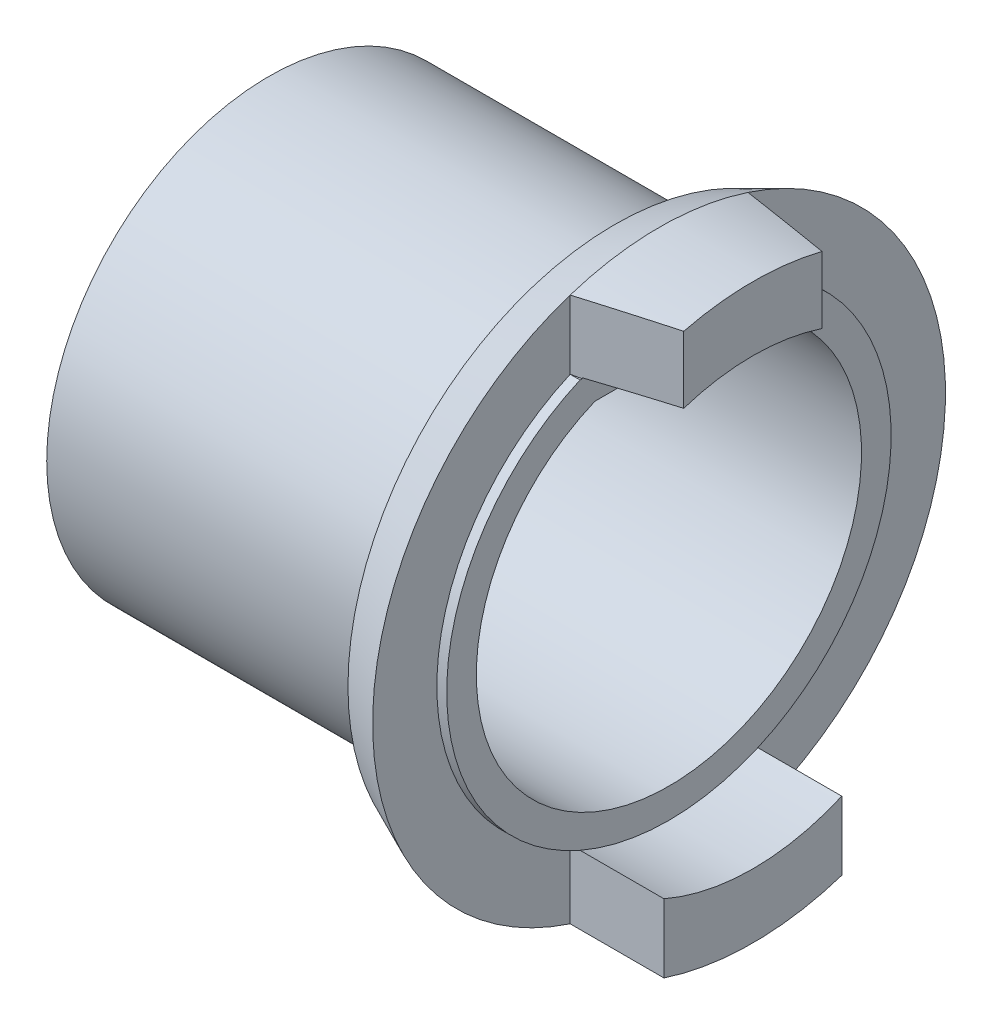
ISO-10303-21;
HEADER;
FILE_DESCRIPTION(('STEP AP214'),'2;1');
FILE_NAME('part.step','',(''),(''),'','','');
FILE_SCHEMA(('AUTOMOTIVE_DESIGN { 1 0 10303 214 1 1 1 1 }'));
ENDSEC;
DATA;
#1=APPLICATION_CONTEXT('core data for automotive mechanical design processes');
#2=APPLICATION_PROTOCOL_DEFINITION('international standard','automotive_design',2000,#1);
#3=PRODUCT_CONTEXT('',#1,'mechanical');
#4=PRODUCT('Part','Part','',(#3));
#5=PRODUCT_RELATED_PRODUCT_CATEGORY('part','',(#4));
#6=PRODUCT_DEFINITION_FORMATION('','',#4);
#7=PRODUCT_DEFINITION_CONTEXT('part definition',#1,'design');
#8=PRODUCT_DEFINITION('design','',#6,#7);
#9=PRODUCT_DEFINITION_SHAPE('','',#8);
#10=(LENGTH_UNIT() NAMED_UNIT(*) SI_UNIT(.MILLI.,.METRE.));
#11=(NAMED_UNIT(*) PLANE_ANGLE_UNIT() SI_UNIT($,.RADIAN.));
#12=(NAMED_UNIT(*) SI_UNIT($,.STERADIAN.) SOLID_ANGLE_UNIT());
#13=UNCERTAINTY_MEASURE_WITH_UNIT(LENGTH_MEASURE(1.E-05),#10,'distance_accuracy_value','');
#14=(GEOMETRIC_REPRESENTATION_CONTEXT(3) GLOBAL_UNCERTAINTY_ASSIGNED_CONTEXT((#13)) GLOBAL_UNIT_ASSIGNED_CONTEXT((#10,
#11,#12)) REPRESENTATION_CONTEXT('',''));
#15=CARTESIAN_POINT('',(0.,0.,0.));
#16=DIRECTION('',(0.,0.,1.));
#17=DIRECTION('',(1.,0.,0.));
#18=AXIS2_PLACEMENT_3D('',#15,#16,#17);
#19=CARTESIAN_POINT('',(65.7492570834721,29.0000000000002,-2.22044604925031E-13));
#20=DIRECTION('',(-1.,0.,0.));
#21=DIRECTION('',(0.,0.,1.));
#22=AXIS2_PLACEMENT_3D('',#19,#20,#21);
#23=PLANE('',#22);
#24=DIRECTION('',(0.,1.,0.));
#25=VECTOR('',#24,1.);
#26=CARTESIAN_POINT('',(65.7492570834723,-27.5680975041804,-9.00000000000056));
#27=LINE('',#26,#25);
#28=CARTESIAN_POINT('',(65.7492570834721,-27.5680975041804,-9.00000000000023));
#29=VERTEX_POINT('',#28);
#30=CARTESIAN_POINT('',(65.7492570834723,-20.6215906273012,-9.00000000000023));
#31=VERTEX_POINT('',#30);
#32=EDGE_CURVE('E263',#29,#31,#27,.T.);
#33=ORIENTED_EDGE('',*,*,#32,.F.);
#34=CARTESIAN_POINT('',(65.7492570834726,0.,-2.22044604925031E-13));
#35=DIRECTION('',(-1.,0.,0.));
#36=DIRECTION('',(0.,0.,1.));
#37=AXIS2_PLACEMENT_3D('',#34,#35,#36);
#38=CIRCLE('',#37,29.);
#39=CARTESIAN_POINT('',(65.7492570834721,27.5680975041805,-9.00000000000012));
#40=VERTEX_POINT('',#39);
#41=EDGE_CURVE('E154',#40,#29,#38,.T.);
#42=ORIENTED_EDGE('',*,*,#41,.F.);
#43=DIRECTION('',(0.,1.,0.));
#44=VECTOR('',#43,1.);
#45=CARTESIAN_POINT('',(65.7492570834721,27.5680975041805,-9.00000000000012));
#46=LINE('',#45,#44);
#47=CARTESIAN_POINT('',(65.7492570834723,20.6215906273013,-9.00000000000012));
#48=VERTEX_POINT('',#47);
#49=EDGE_CURVE('E190',#48,#40,#46,.T.);
#50=ORIENTED_EDGE('',*,*,#49,.F.);
#51=CARTESIAN_POINT('',(65.7492570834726,0.,-2.22044604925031E-13));
#52=DIRECTION('',(-1.,0.,0.));
#53=DIRECTION('',(0.,0.,1.));
#54=AXIS2_PLACEMENT_3D('',#51,#52,#53);
#55=CIRCLE('',#54,22.5);
#56=EDGE_CURVE('E223',#48,#31,#55,.T.);
#57=ORIENTED_EDGE('',*,*,#56,.T.);
#58=EDGE_LOOP('',(#33,#42,#50,#57));
#59=FACE_BOUND('',#58,.T.);
#60=ADVANCED_FACE('F32',(#59),#23,.F.);
#61=DIRECTION('',(0.,-1.,0.));
#62=VECTOR('',#61,1.);
#63=CARTESIAN_POINT('',(65.7492570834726,-27.5680975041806,8.99999999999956));
#64=LINE('',#63,#62);
#65=CARTESIAN_POINT('',(65.7492570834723,-20.6215906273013,8.99999999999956));
#66=VERTEX_POINT('',#65);
#67=CARTESIAN_POINT('',(65.7492570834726,-27.5680975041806,8.99999999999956));
#68=VERTEX_POINT('',#67);
#69=EDGE_CURVE('E55',#66,#68,#64,.T.);
#70=ORIENTED_EDGE('',*,*,#69,.F.);
#71=CARTESIAN_POINT('',(65.7492570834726,20.6215906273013,9.00000000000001));
#72=VERTEX_POINT('',#71);
#73=EDGE_CURVE('E221',#66,#72,#55,.T.);
#74=ORIENTED_EDGE('',*,*,#73,.T.);
#75=DIRECTION('',(0.,-1.,0.));
#76=VECTOR('',#75,1.);
#77=CARTESIAN_POINT('',(65.7492570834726,27.5680975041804,8.9999999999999));
#78=LINE('',#77,#76);
#79=CARTESIAN_POINT('',(65.7492570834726,27.5680975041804,8.9999999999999));
#80=VERTEX_POINT('',#79);
#81=EDGE_CURVE('E188',#80,#72,#78,.T.);
#82=ORIENTED_EDGE('',*,*,#81,.F.);
#83=EDGE_CURVE('E156',#68,#80,#38,.T.);
#84=ORIENTED_EDGE('',*,*,#83,.F.);
#85=EDGE_LOOP('',(#70,#74,#82,#84));
#86=FACE_BOUND('',#85,.T.);
#87=ADVANCED_FACE('F230',(#86),#23,.F.);
#88=CARTESIAN_POINT('',(-130.,-1.38777878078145E-13,0.));
#89=DIRECTION('',(-1.,0.,0.));
#90=DIRECTION('',(0.,0.,1.));
#91=AXIS2_PLACEMENT_3D('',#88,#89,#90);
#92=CYLINDRICAL_SURFACE('',#91,22.5);
#93=DIRECTION('',(-1.,0.,0.));
#94=VECTOR('',#93,1.);
#95=CARTESIAN_POINT('',(75.2492570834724,-20.6215906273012,-9.00000000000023));
#96=LINE('',#95,#94);
#97=CARTESIAN_POINT('',(66.7492570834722,-20.6215906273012,-9.00000000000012));
#98=VERTEX_POINT('',#97);
#99=EDGE_CURVE('E255',#98,#31,#96,.T.);
#100=ORIENTED_EDGE('',*,*,#99,.T.);
#101=ORIENTED_EDGE('',*,*,#56,.F.);
#102=DIRECTION('',(-1.,0.,0.));
#103=VECTOR('',#102,1.);
#104=CARTESIAN_POINT('',(75.2492570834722,20.6215906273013,-9.00000000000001));
#105=LINE('',#104,#103);
#106=CARTESIAN_POINT('',(66.7492570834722,20.6215906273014,-9.00000000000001));
#107=VERTEX_POINT('',#106);
#108=EDGE_CURVE('E195',#107,#48,#105,.T.);
#109=ORIENTED_EDGE('',*,*,#108,.F.);
#110=CARTESIAN_POINT('',(66.7492570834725,0.,-2.22044604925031E-13));
#111=DIRECTION('',(-1.,0.,0.));
#112=DIRECTION('',(0.,0.,1.));
#113=AXIS2_PLACEMENT_3D('',#110,#111,#112);
#114=CIRCLE('',#113,22.5);
#115=EDGE_CURVE('E222',#107,#98,#114,.T.);
#116=ORIENTED_EDGE('',*,*,#115,.T.);
#117=EDGE_LOOP('',(#100,#101,#109,#116));
#118=FACE_BOUND('',#117,.T.);
#119=ADVANCED_FACE('F254',(#118),#92,.T.);
#120=DIRECTION('',(-1.,0.,0.));
#121=VECTOR('',#120,1.);
#122=CARTESIAN_POINT('',(75.2492570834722,-20.6215906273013,8.99999999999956));
#123=LINE('',#122,#121);
#124=CARTESIAN_POINT('',(66.7492570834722,-20.6215906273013,8.99999999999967));
#125=VERTEX_POINT('',#124);
#126=EDGE_CURVE('E241',#125,#66,#123,.T.);
#127=ORIENTED_EDGE('',*,*,#126,.F.);
#128=CARTESIAN_POINT('',(66.7492570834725,20.6215906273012,8.9999999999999));
#129=VERTEX_POINT('',#128);
#130=EDGE_CURVE('E218',#125,#129,#114,.T.);
#131=ORIENTED_EDGE('',*,*,#130,.T.);
#132=DIRECTION('',(-1.,0.,0.));
#133=VECTOR('',#132,1.);
#134=CARTESIAN_POINT('',(75.2492570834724,20.6215906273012,9.00000000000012));
#135=LINE('',#134,#133);
#136=EDGE_CURVE('E197',#129,#72,#135,.T.);
#137=ORIENTED_EDGE('',*,*,#136,.T.);
#138=ORIENTED_EDGE('',*,*,#73,.F.);
#139=EDGE_LOOP('',(#127,#131,#137,#138));
#140=FACE_BOUND('',#139,.T.);
#141=ADVANCED_FACE('F240',(#140),#92,.T.);
#142=CARTESIAN_POINT('',(65.7492570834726,0.,-2.22044604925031E-13));
#143=DIRECTION('',(1.,0.,0.));
#144=DIRECTION('',(0.,0.,-1.));
#145=AXIS2_PLACEMENT_3D('',#142,#143,#144);
#146=CONICAL_SURFACE('',#145,29.,0.418224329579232);
#147=CARTESIAN_POINT('',(61.2492570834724,0.,0.));
#148=DIRECTION('',(-1.,0.,0.));
#149=DIRECTION('',(0.,0.,1.));
#150=AXIS2_PLACEMENT_3D('',#147,#148,#149);
#151=CIRCLE('',#150,27.);
#152=CARTESIAN_POINT('',(61.2492570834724,0.,27.));
#153=VERTEX_POINT('',#152);
#154=EDGE_CURVE('E200',#153,#153,#151,.T.);
#155=ORIENTED_EDGE('',*,*,#154,.F.);
#156=EDGE_LOOP('',(#155));
#157=FACE_BOUND('',#156,.T.);
#158=EDGE_CURVE('E149',#80,#40,#38,.T.);
#159=ORIENTED_EDGE('',*,*,#158,.T.);
#160=ORIENTED_EDGE('',*,*,#41,.T.);
#161=CARTESIAN_POINT('',(65.7492570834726,0.,-2.22044604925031E-13));
#162=DIRECTION('',(1.,0.,0.));
#163=DIRECTION('',(0.,0.,1.));
#164=AXIS2_PLACEMENT_3D('',#161,#162,#163);
#165=CIRCLE('',#164,29.);
#166=EDGE_CURVE('E138',#68,#29,#165,.T.);
#167=ORIENTED_EDGE('',*,*,#166,.F.);
#168=ORIENTED_EDGE('',*,*,#83,.T.);
#169=EDGE_LOOP('',(#159,#160,#167,#168));
#170=FACE_BOUND('',#169,.T.);
#171=ADVANCED_FACE('F34',(#157,#170),#146,.T.);
#172=CARTESIAN_POINT('',(66.7492570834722,22.5000000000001,-2.22044604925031E-13));
#173=DIRECTION('',(-1.,0.,0.));
#174=DIRECTION('',(0.,0.,1.));
#175=AXIS2_PLACEMENT_3D('',#172,#173,#174);
#176=PLANE('',#175);
#177=DIRECTION('',(0.,0.,-1.));
#178=VECTOR('',#177,1.);
#179=CARTESIAN_POINT('',(66.7492570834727,17.9999999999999,10.8942652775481));
#180=LINE('',#179,#178);
#181=CARTESIAN_POINT('',(66.7492570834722,17.9999999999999,7.49999999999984));
#182=VERTEX_POINT('',#181);
#183=CARTESIAN_POINT('',(66.7492570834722,17.9999999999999,-7.50000000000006));
#184=VERTEX_POINT('',#183);
#185=EDGE_CURVE('E133',#182,#184,#180,.T.);
#186=ORIENTED_EDGE('',*,*,#185,.T.);
#187=CARTESIAN_POINT('',(66.7492570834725,0.,-2.22044604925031E-13));
#188=DIRECTION('',(-1.,0.,0.));
#189=DIRECTION('',(0.,0.,1.));
#190=AXIS2_PLACEMENT_3D('',#187,#188,#189);
#191=CIRCLE('',#190,19.5);
#192=EDGE_CURVE('E216',#184,#182,#191,.T.);
#193=ORIENTED_EDGE('',*,*,#192,.T.);
#194=EDGE_LOOP('',(#186,#193));
#195=FACE_BOUND('',#194,.T.);
#196=DIRECTION('',(0.,0.,1.));
#197=VECTOR('',#196,1.);
#198=CARTESIAN_POINT('',(66.7492570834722,20.6215906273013,0.));
#199=LINE('',#198,#197);
#200=CARTESIAN_POINT('',(66.7492570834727,20.6215906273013,-8.78947368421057));
#201=VERTEX_POINT('',#200);
#202=EDGE_CURVE('E276',#107,#201,#199,.T.);
#203=ORIENTED_EDGE('',*,*,#202,.T.);
#204=DIRECTION('',(0.,1.,0.));
#205=VECTOR('',#204,1.);
#206=CARTESIAN_POINT('',(66.7492570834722,22.5,-8.78947368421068));
#207=LINE('',#206,#205);
#208=CARTESIAN_POINT('',(66.7492570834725,20.7121981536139,-8.78947368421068));
#209=VERTEX_POINT('',#208);
#210=EDGE_CURVE('E239',#201,#209,#207,.T.);
#211=ORIENTED_EDGE('',*,*,#210,.T.);
#212=CARTESIAN_POINT('',(66.7492570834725,20.7121981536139,8.78947368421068));
#213=VERTEX_POINT('',#212);
#214=EDGE_CURVE('E219',#213,#209,#114,.T.);
#215=ORIENTED_EDGE('',*,*,#214,.F.);
#216=DIRECTION('',(0.,-1.,0.));
#217=VECTOR('',#216,1.);
#218=CARTESIAN_POINT('',(66.7492570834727,22.4999999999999,8.78947368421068));
#219=LINE('',#218,#217);
#220=CARTESIAN_POINT('',(66.7492570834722,20.6215906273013,8.78947368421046));
#221=VERTEX_POINT('',#220);
#222=EDGE_CURVE('E180',#213,#221,#219,.T.);
#223=ORIENTED_EDGE('',*,*,#222,.T.);
#224=DIRECTION('',(0.,0.,-1.));
#225=VECTOR('',#224,1.);
#226=CARTESIAN_POINT('',(66.7492570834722,20.6215906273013,0.));
#227=LINE('',#226,#225);
#228=EDGE_CURVE('E178',#129,#221,#227,.T.);
#229=ORIENTED_EDGE('',*,*,#228,.F.);
#230=ORIENTED_EDGE('',*,*,#130,.F.);
#231=EDGE_CURVE('E244',#98,#125,#114,.T.);
#232=ORIENTED_EDGE('',*,*,#231,.F.);
#233=ORIENTED_EDGE('',*,*,#115,.F.);
#234=EDGE_LOOP('',(#203,#211,#215,#223,#229,#230,#232,#233));
#235=FACE_BOUND('',#234,.T.);
#236=ADVANCED_FACE('F285',(#195,#235),#176,.F.);
#237=CARTESIAN_POINT('',(-130.,-1.38777878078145E-13,0.));
#238=DIRECTION('',(-1.,0.,0.));
#239=DIRECTION('',(0.,0.,1.));
#240=AXIS2_PLACEMENT_3D('',#237,#238,#239);
#241=CYLINDRICAL_SURFACE('',#240,19.5);
#242=CARTESIAN_POINT('',(27.9492570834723,0.,0.));
#243=DIRECTION('',(1.,0.,0.));
#244=DIRECTION('',(0.,0.,-1.));
#245=AXIS2_PLACEMENT_3D('',#242,#243,#244);
#246=CIRCLE('',#245,19.5);
#247=CARTESIAN_POINT('',(27.9492570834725,18.,-7.49999999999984));
#248=VERTEX_POINT('',#247);
#249=CARTESIAN_POINT('',(27.9492570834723,18.,7.49999999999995));
#250=VERTEX_POINT('',#249);
#251=EDGE_CURVE('E145',#248,#250,#246,.F.);
#252=ORIENTED_EDGE('',*,*,#251,.T.);
#253=DIRECTION('',(-1.,0.,0.));
#254=VECTOR('',#253,1.);
#255=CARTESIAN_POINT('',(-130.,18.,7.50000000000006));
#256=LINE('',#255,#254);
#257=EDGE_CURVE('E130',#250,#182,#256,.F.);
#258=ORIENTED_EDGE('',*,*,#257,.T.);
#259=ORIENTED_EDGE('',*,*,#192,.F.);
#260=DIRECTION('',(-1.,0.,0.));
#261=VECTOR('',#260,1.);
#262=CARTESIAN_POINT('',(-130.,17.9999999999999,-7.50000000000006));
#263=LINE('',#262,#261);
#264=EDGE_CURVE('E139',#184,#248,#263,.T.);
#265=ORIENTED_EDGE('',*,*,#264,.T.);
#266=EDGE_LOOP('',(#252,#258,#259,#265));
#267=FACE_BOUND('',#266,.T.);
#268=ADVANCED_FACE('F147',(#267),#241,.F.);
#269=CARTESIAN_POINT('',(26.2492570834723,22.4999999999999,-2.22044604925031E-13));
#270=DIRECTION('',(1.,0.,0.));
#271=DIRECTION('',(0.,0.,-1.));
#272=AXIS2_PLACEMENT_3D('',#269,#270,#271);
#273=PLANE('',#272);
#274=CARTESIAN_POINT('',(26.2492570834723,0.,-2.22044604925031E-13));
#275=DIRECTION('',(1.,0.,0.));
#276=DIRECTION('',(0.,0.,-1.));
#277=AXIS2_PLACEMENT_3D('',#274,#275,#276);
#278=CIRCLE('',#277,21.2);
#279=CARTESIAN_POINT('',(26.2492570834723,0.,-21.2000000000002));
#280=VERTEX_POINT('',#279);
#281=EDGE_CURVE('E148',#280,#280,#278,.T.);
#282=ORIENTED_EDGE('',*,*,#281,.T.);
#283=EDGE_LOOP('',(#282));
#284=FACE_BOUND('',#283,.T.);
#285=CARTESIAN_POINT('',(26.2492570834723,0.,-2.22044604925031E-13));
#286=DIRECTION('',(-1.,0.,0.));
#287=DIRECTION('',(0.,0.,1.));
#288=AXIS2_PLACEMENT_3D('',#285,#286,#287);
#289=CIRCLE('',#288,22.5);
#290=CARTESIAN_POINT('',(26.2492570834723,-1.30728802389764E-13,22.5));
#291=VERTEX_POINT('',#290);
#292=EDGE_CURVE('E213',#291,#291,#289,.T.);
#293=ORIENTED_EDGE('',*,*,#292,.T.);
#294=EDGE_LOOP('',(#293));
#295=FACE_BOUND('',#294,.T.);
#296=ADVANCED_FACE('F372',(#284,#295),#273,.F.);
#297=CARTESIAN_POINT('',(-130.,-1.38777878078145E-13,0.));
#298=DIRECTION('',(-1.,0.,0.));
#299=DIRECTION('',(0.,0.,1.));
#300=AXIS2_PLACEMENT_3D('',#297,#298,#299);
#301=CYLINDRICAL_SURFACE('',#300,22.5);
#302=CARTESIAN_POINT('',(59.2492570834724,0.,-1.11022302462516E-13));
#303=DIRECTION('',(-1.,0.,0.));
#304=DIRECTION('',(0.,0.,1.));
#305=AXIS2_PLACEMENT_3D('',#302,#303,#304);
#306=CIRCLE('',#305,22.5);
#307=CARTESIAN_POINT('',(59.2492570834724,-1.28896934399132E-13,22.5));
#308=VERTEX_POINT('',#307);
#309=EDGE_CURVE('E210',#308,#308,#306,.T.);
#310=CARTESIAN_POINT('',(26.2492570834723,-1.30728802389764E-13,22.5));
#311=CARTESIAN_POINT('',(26.5930070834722,-1.30709720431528E-13,22.5));
#312=CARTESIAN_POINT('',(26.9367570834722,-1.30690638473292E-13,22.5));
#313=CARTESIAN_POINT('',(27.6242570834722,-1.30652474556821E-13,22.5));
#314=CARTESIAN_POINT('',(27.9680070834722,-1.30633392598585E-13,22.5));
#315=CARTESIAN_POINT('',(28.6555070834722,-1.30595228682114E-13,22.5));
#316=CARTESIAN_POINT('',(28.9992570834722,-1.30576146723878E-13,22.5));
#317=CARTESIAN_POINT('',(29.6867570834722,-1.30537982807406E-13,22.5));
#318=CARTESIAN_POINT('',(30.0305070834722,-1.30518900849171E-13,22.5));
#319=CARTESIAN_POINT('',(30.7180070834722,-1.30480736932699E-13,22.5));
#320=CARTESIAN_POINT('',(31.0617570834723,-1.30461654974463E-13,22.5));
#321=CARTESIAN_POINT('',(31.7492570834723,-1.30423491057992E-13,22.5));
#322=CARTESIAN_POINT('',(32.0930070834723,-1.30404409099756E-13,22.5));
#323=CARTESIAN_POINT('',(32.7805070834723,-1.30366245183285E-13,22.5));
#324=CARTESIAN_POINT('',(33.1242570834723,-1.30347163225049E-13,22.5));
#325=CARTESIAN_POINT('',(33.8117570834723,-1.30308999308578E-13,22.5));
#326=CARTESIAN_POINT('',(34.1555070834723,-1.30289917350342E-13,22.5));
#327=CARTESIAN_POINT('',(34.8430070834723,-1.3025175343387E-13,22.5));
#328=CARTESIAN_POINT('',(35.1867570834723,-1.30232671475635E-13,22.5));
#329=CARTESIAN_POINT('',(35.8742570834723,-1.30194507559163E-13,22.5));
#330=CARTESIAN_POINT('',(36.2180070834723,-1.30175425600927E-13,22.5));
#331=CARTESIAN_POINT('',(36.9055070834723,-1.30137261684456E-13,22.5));
#332=CARTESIAN_POINT('',(37.2492570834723,-1.3011817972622E-13,22.5));
#333=CARTESIAN_POINT('',(37.9367570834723,-1.30080015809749E-13,22.5));
#334=CARTESIAN_POINT('',(38.2805070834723,-1.30060933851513E-13,22.5));
#335=CARTESIAN_POINT('',(38.9680070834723,-1.30022769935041E-13,22.5));
#336=CARTESIAN_POINT('',(39.3117570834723,-1.30003687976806E-13,22.5));
#337=CARTESIAN_POINT('',(39.9992570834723,-1.29965524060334E-13,22.5));
#338=CARTESIAN_POINT('',(40.3430070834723,-1.29946442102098E-13,22.5));
#339=CARTESIAN_POINT('',(41.0305070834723,-1.29908278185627E-13,22.5));
#340=CARTESIAN_POINT('',(41.3742570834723,-1.29889196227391E-13,22.5));
#341=CARTESIAN_POINT('',(42.0617570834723,-1.2985103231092E-13,22.5));
#342=CARTESIAN_POINT('',(42.4055070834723,-1.29831950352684E-13,22.5));
#343=CARTESIAN_POINT('',(43.0930070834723,-1.29793786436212E-13,22.5));
#344=CARTESIAN_POINT('',(43.4367570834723,-1.29774704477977E-13,22.5));
#345=CARTESIAN_POINT('',(44.1242570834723,-1.29736540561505E-13,22.5));
#346=CARTESIAN_POINT('',(44.4680070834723,-1.29717458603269E-13,22.5));
#347=CARTESIAN_POINT('',(45.1555070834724,-1.29679294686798E-13,22.5));
#348=CARTESIAN_POINT('',(45.4992570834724,-1.29660212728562E-13,22.5));
#349=CARTESIAN_POINT('',(46.1867570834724,-1.29622048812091E-13,22.5));
#350=CARTESIAN_POINT('',(46.5305070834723,-1.29602966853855E-13,22.5));
#351=CARTESIAN_POINT('',(47.2180070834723,-1.29564802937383E-13,22.5));
#352=CARTESIAN_POINT('',(47.5617570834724,-1.29545720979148E-13,22.5));
#353=CARTESIAN_POINT('',(48.2492570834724,-1.29507557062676E-13,22.5));
#354=CARTESIAN_POINT('',(48.5930070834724,-1.2948847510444E-13,22.5));
#355=CARTESIAN_POINT('',(49.2805070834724,-1.29450311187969E-13,22.5));
#356=CARTESIAN_POINT('',(49.6242570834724,-1.29431229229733E-13,22.5));
#357=CARTESIAN_POINT('',(50.3117570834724,-1.29393065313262E-13,22.5));
#358=CARTESIAN_POINT('',(50.6555070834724,-1.29373983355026E-13,22.5));
#359=CARTESIAN_POINT('',(51.3430070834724,-1.29335819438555E-13,22.5));
#360=CARTESIAN_POINT('',(51.6867570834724,-1.29316737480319E-13,22.5));
#361=CARTESIAN_POINT('',(52.3742570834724,-1.29278573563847E-13,22.5));
#362=CARTESIAN_POINT('',(52.7180070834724,-1.29259491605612E-13,22.5));
#363=CARTESIAN_POINT('',(53.4055070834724,-1.2922132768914E-13,22.5));
#364=CARTESIAN_POINT('',(53.7492570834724,-1.29202245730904E-13,22.5));
#365=CARTESIAN_POINT('',(54.4367570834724,-1.29164081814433E-13,22.5));
#366=CARTESIAN_POINT('',(54.7805070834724,-1.29144999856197E-13,22.5));
#367=CARTESIAN_POINT('',(55.4680070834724,-1.29106835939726E-13,22.5));
#368=CARTESIAN_POINT('',(55.8117570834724,-1.2908775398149E-13,22.5));
#369=CARTESIAN_POINT('',(56.4992570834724,-1.29049590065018E-13,22.5));
#370=CARTESIAN_POINT('',(56.8430070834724,-1.29030508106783E-13,22.5));
#371=CARTESIAN_POINT('',(57.5305070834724,-1.28992344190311E-13,22.5));
#372=CARTESIAN_POINT('',(57.8742570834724,-1.28973262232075E-13,22.5));
#373=CARTESIAN_POINT('',(58.5617570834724,-1.28935098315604E-13,22.5));
#374=CARTESIAN_POINT('',(58.9055070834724,-1.28916016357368E-13,22.5));
#375=CARTESIAN_POINT('',(59.2492570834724,-1.28896934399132E-13,22.5));
#376=B_SPLINE_CURVE_WITH_KNOTS('',3,(#310,#311,#312,#313,#314,#315,#316,#317,#318,#319,#320,
#321,#322,#323,#324,#325,#326,#327,#328,#329,#330,#331,#332,#333,#334,#335,#336,#337,#338,#339,
#340,#341,#342,#343,#344,#345,#346,#347,#348,#349,#350,#351,#352,#353,#354,#355,#356,#357,#358,
#359,#360,#361,#362,#363,#364,#365,#366,#367,#368,#369,#370,#371,#372,#373,#374,#375),
.UNSPECIFIED.,.F.,.F.,(4,2,2,2,2,2,2,2,2,2,2,2,2,2,2,2,2,2,2,2,2,2,2,2,2,2,2,2,2,2,2,2,4),(0.,
1.03124999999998,2.06249999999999,3.09374999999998,4.12499999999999,5.15625,6.18750000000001,
7.21875000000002,8.25000000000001,9.28125000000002,10.3125,11.34375,12.3750000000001,
13.4062500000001,14.4375,15.4687500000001,16.5000000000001,17.5312500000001,18.5625000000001,
19.5937500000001,20.6250000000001,21.6562500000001,22.6875000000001,23.7187500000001,
24.7500000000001,25.7812500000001,26.8125000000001,27.8437500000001,28.8750000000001,
29.9062500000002,30.9375000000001,31.9687500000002,33.0000000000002),.UNSPECIFIED.);
#377=EDGE_CURVE('BSEAM375',#291,#308,#376,.T.);
#378=ORIENTED_EDGE('',*,*,#292,.F.);
#379=ORIENTED_EDGE('',*,*,#309,.T.);
#380=ORIENTED_EDGE('',*,*,#377,.T.);
#381=ORIENTED_EDGE('',*,*,#377,.F.);
#382=EDGE_LOOP('',(#378,#380,#379,#381));
#383=FACE_BOUND('',#382,.T.);
#384=ADVANCED_FACE('F375',(#383),#301,.T.);
#385=CARTESIAN_POINT('',(59.2492570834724,22.5,-2.22044604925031E-13));
#386=DIRECTION('',(-1.,0.,0.));
#387=DIRECTION('',(0.,0.,1.));
#388=AXIS2_PLACEMENT_3D('',#385,#386,#387);
#389=PLANE('',#388);
#390=ORIENTED_EDGE('',*,*,#309,.F.);
#391=EDGE_LOOP('',(#390));
#392=FACE_BOUND('',#391,.T.);
#393=CARTESIAN_POINT('',(59.2492570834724,0.,-1.11022302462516E-13));
#394=DIRECTION('',(-1.,0.,0.));
#395=DIRECTION('',(0.,0.,1.));
#396=AXIS2_PLACEMENT_3D('',#393,#394,#395);
#397=CIRCLE('',#396,22.4);
#398=CARTESIAN_POINT('',(59.2492570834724,-1.28894158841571E-13,22.4));
#399=VERTEX_POINT('',#398);
#400=EDGE_CURVE('E207',#399,#399,#397,.T.);
#401=ORIENTED_EDGE('',*,*,#400,.T.);
#402=EDGE_LOOP('',(#401));
#403=FACE_BOUND('',#402,.T.);
#404=ADVANCED_FACE('F379',(#392,#403),#389,.F.);
#405=CARTESIAN_POINT('',(-130.,-1.38777878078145E-13,0.));
#406=DIRECTION('',(-1.,0.,0.));
#407=DIRECTION('',(0.,0.,1.));
#408=AXIS2_PLACEMENT_3D('',#405,#406,#407);
#409=CYLINDRICAL_SURFACE('',#408,22.4);
#410=CARTESIAN_POINT('',(61.2492570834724,0.,0.));
#411=DIRECTION('',(-1.,0.,0.));
#412=DIRECTION('',(0.,0.,1.));
#413=AXIS2_PLACEMENT_3D('',#410,#411,#412);
#414=CIRCLE('',#413,22.4);
#415=CARTESIAN_POINT('',(61.2492570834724,-1.28783136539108E-13,22.4));
#416=VERTEX_POINT('',#415);
#417=EDGE_CURVE('E203',#416,#416,#414,.T.);
#418=CARTESIAN_POINT('',(59.2492570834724,-1.28894158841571E-13,22.4));
#419=CARTESIAN_POINT('',(59.2700904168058,-1.28893002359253E-13,22.4));
#420=CARTESIAN_POINT('',(59.2909237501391,-1.28891845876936E-13,22.4));
#421=CARTESIAN_POINT('',(59.3325904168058,-1.28889532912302E-13,22.4));
#422=CARTESIAN_POINT('',(59.3534237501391,-1.28888376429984E-13,22.4));
#423=CARTESIAN_POINT('',(59.3950904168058,-1.2888606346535E-13,22.4));
#424=CARTESIAN_POINT('',(59.4159237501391,-1.28884906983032E-13,22.4));
#425=CARTESIAN_POINT('',(59.4575904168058,-1.28882594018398E-13,22.4));
#426=CARTESIAN_POINT('',(59.4784237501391,-1.2888143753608E-13,22.4));
#427=CARTESIAN_POINT('',(59.5200904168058,-1.28879124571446E-13,22.4));
#428=CARTESIAN_POINT('',(59.5409237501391,-1.28877968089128E-13,22.4));
#429=CARTESIAN_POINT('',(59.5825904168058,-1.28875655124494E-13,22.4));
#430=CARTESIAN_POINT('',(59.6034237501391,-1.28874498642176E-13,22.4));
#431=CARTESIAN_POINT('',(59.6450904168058,-1.28872185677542E-13,22.4));
#432=CARTESIAN_POINT('',(59.6659237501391,-1.28871029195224E-13,22.4));
#433=CARTESIAN_POINT('',(59.7075904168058,-1.2886871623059E-13,22.4));
#434=CARTESIAN_POINT('',(59.7284237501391,-1.28867559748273E-13,22.4));
#435=CARTESIAN_POINT('',(59.7700904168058,-1.28865246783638E-13,22.4));
#436=CARTESIAN_POINT('',(59.7909237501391,-1.28864090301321E-13,22.4));
#437=CARTESIAN_POINT('',(59.8325904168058,-1.28861777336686E-13,22.4));
#438=CARTESIAN_POINT('',(59.8534237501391,-1.28860620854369E-13,22.4));
#439=CARTESIAN_POINT('',(59.8950904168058,-1.28858307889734E-13,22.4));
#440=CARTESIAN_POINT('',(59.9159237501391,-1.28857151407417E-13,22.4));
#441=CARTESIAN_POINT('',(59.9575904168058,-1.28854838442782E-13,22.4));
#442=CARTESIAN_POINT('',(59.9784237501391,-1.28853681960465E-13,22.4));
#443=CARTESIAN_POINT('',(60.0200904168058,-1.2885136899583E-13,22.4));
#444=CARTESIAN_POINT('',(60.0409237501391,-1.28850212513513E-13,22.4));
#445=CARTESIAN_POINT('',(60.0825904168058,-1.28847899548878E-13,22.4));
#446=CARTESIAN_POINT('',(60.1034237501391,-1.28846743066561E-13,22.4));
#447=CARTESIAN_POINT('',(60.1450904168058,-1.28844430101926E-13,22.4));
#448=CARTESIAN_POINT('',(60.1659237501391,-1.28843273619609E-13,22.4));
#449=CARTESIAN_POINT('',(60.2075904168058,-1.28840960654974E-13,22.4));
#450=CARTESIAN_POINT('',(60.2284237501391,-1.28839804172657E-13,22.4));
#451=CARTESIAN_POINT('',(60.2700904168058,-1.28837491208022E-13,22.4));
#452=CARTESIAN_POINT('',(60.2909237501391,-1.28836334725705E-13,22.4));
#453=CARTESIAN_POINT('',(60.3325904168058,-1.2883402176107E-13,22.4));
#454=CARTESIAN_POINT('',(60.3534237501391,-1.28832865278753E-13,22.4));
#455=CARTESIAN_POINT('',(60.3950904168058,-1.28830552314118E-13,22.4));
#456=CARTESIAN_POINT('',(60.4159237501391,-1.28829395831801E-13,22.4));
#457=CARTESIAN_POINT('',(60.4575904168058,-1.28827082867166E-13,22.4));
#458=CARTESIAN_POINT('',(60.4784237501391,-1.28825926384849E-13,22.4));
#459=CARTESIAN_POINT('',(60.5200904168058,-1.28823613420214E-13,22.4));
#460=CARTESIAN_POINT('',(60.5409237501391,-1.28822456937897E-13,22.4));
#461=CARTESIAN_POINT('',(60.5825904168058,-1.28820143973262E-13,22.4));
#462=CARTESIAN_POINT('',(60.6034237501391,-1.28818987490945E-13,22.4));
#463=CARTESIAN_POINT('',(60.6450904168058,-1.28816674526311E-13,22.4));
#464=CARTESIAN_POINT('',(60.6659237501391,-1.28815518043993E-13,22.4));
#465=CARTESIAN_POINT('',(60.7075904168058,-1.28813205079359E-13,22.4));
#466=CARTESIAN_POINT('',(60.7284237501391,-1.28812048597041E-13,22.4));
#467=CARTESIAN_POINT('',(60.7700904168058,-1.28809735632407E-13,22.4));
#468=CARTESIAN_POINT('',(60.7909237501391,-1.28808579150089E-13,22.4));
#469=CARTESIAN_POINT('',(60.8325904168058,-1.28806266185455E-13,22.4));
#470=CARTESIAN_POINT('',(60.8534237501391,-1.28805109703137E-13,22.4));
#471=CARTESIAN_POINT('',(60.8950904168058,-1.28802796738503E-13,22.4));
#472=CARTESIAN_POINT('',(60.9159237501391,-1.28801640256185E-13,22.4));
#473=CARTESIAN_POINT('',(60.9575904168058,-1.28799327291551E-13,22.4));
#474=CARTESIAN_POINT('',(60.9784237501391,-1.28798170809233E-13,22.4));
#475=CARTESIAN_POINT('',(61.0200904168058,-1.28795857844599E-13,22.4));
#476=CARTESIAN_POINT('',(61.0409237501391,-1.28794701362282E-13,22.4));
#477=CARTESIAN_POINT('',(61.0825904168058,-1.28792388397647E-13,22.4));
#478=CARTESIAN_POINT('',(61.1034237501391,-1.2879123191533E-13,22.4));
#479=CARTESIAN_POINT('',(61.1450904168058,-1.28788918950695E-13,22.4));
#480=CARTESIAN_POINT('',(61.1659237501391,-1.28787762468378E-13,22.4));
#481=CARTESIAN_POINT('',(61.2075904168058,-1.28785449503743E-13,22.4));
#482=CARTESIAN_POINT('',(61.2284237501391,-1.28784293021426E-13,22.4));
#483=CARTESIAN_POINT('',(61.2492570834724,-1.28783136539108E-13,22.4));
#484=B_SPLINE_CURVE_WITH_KNOTS('',3,(#418,#419,#420,#421,#422,#423,#424,#425,#426,#427,#428,
#429,#430,#431,#432,#433,#434,#435,#436,#437,#438,#439,#440,#441,#442,#443,#444,#445,#446,#447,
#448,#449,#450,#451,#452,#453,#454,#455,#456,#457,#458,#459,#460,#461,#462,#463,#464,#465,#466,
#467,#468,#469,#470,#471,#472,#473,#474,#475,#476,#477,#478,#479,#480,#481,#482,#483),
.UNSPECIFIED.,.F.,.F.,(4,2,2,2,2,2,2,2,2,2,2,2,2,2,2,2,2,2,2,2,2,2,2,2,2,2,2,2,2,2,2,2,4),(0.,
0.0624999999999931,0.124999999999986,0.187500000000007,0.25,0.312499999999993,0.375000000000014,
0.437500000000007,0.5,0.562499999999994,0.624999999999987,0.687500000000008,0.750000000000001,
0.812499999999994,0.875000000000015,0.937500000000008,1.,1.06249999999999,1.12499999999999,
1.18750000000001,1.25,1.31249999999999,1.37500000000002,1.43750000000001,1.5,1.56249999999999,
1.62499999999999,1.68750000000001,1.75,1.81249999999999,1.87500000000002,1.93750000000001,2.),.UNSPECIFIED.);
#485=EDGE_CURVE('BSEAM383',#399,#416,#484,.T.);
#486=ORIENTED_EDGE('',*,*,#400,.F.);
#487=ORIENTED_EDGE('',*,*,#417,.T.);
#488=ORIENTED_EDGE('',*,*,#485,.T.);
#489=ORIENTED_EDGE('',*,*,#485,.F.);
#490=EDGE_LOOP('',(#486,#488,#487,#489));
#491=FACE_BOUND('',#490,.T.);
#492=ADVANCED_FACE('F383',(#491),#409,.T.);
#493=CARTESIAN_POINT('',(61.2492570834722,22.4000000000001,-2.22044604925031E-13));
#494=DIRECTION('',(1.,0.,0.));
#495=DIRECTION('',(0.,0.,-1.));
#496=AXIS2_PLACEMENT_3D('',#493,#494,#495);
#497=PLANE('',#496);
#498=ORIENTED_EDGE('',*,*,#417,.F.);
#499=EDGE_LOOP('',(#498));
#500=FACE_BOUND('',#499,.T.);
#501=ORIENTED_EDGE('',*,*,#154,.T.);
#502=EDGE_LOOP('',(#501));
#503=FACE_BOUND('',#502,.T.);
#504=ADVANCED_FACE('F386',(#500,#503),#497,.F.);
#505=CARTESIAN_POINT('',(27.9492570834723,0.,0.));
#506=DIRECTION('',(-1.,0.,0.));
#507=DIRECTION('',(0.,0.,1.));
#508=AXIS2_PLACEMENT_3D('',#505,#506,#507);
#509=CONICAL_SURFACE('',#508,19.5,0.785398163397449);
#510=ORIENTED_EDGE('',*,*,#251,.F.);
#511=CARTESIAN_POINT('',(17.762305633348,17.9999999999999,-23.6075218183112));
#512=CARTESIAN_POINT('',(17.9865706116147,18.,-23.3254993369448));
#513=CARTESIAN_POINT('',(18.2099351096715,18.,-23.0427612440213));
#514=CARTESIAN_POINT('',(18.6546856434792,18.0000000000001,-22.4757271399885));
#515=CARTESIAN_POINT('',(18.876071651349,18.0000000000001,-22.1914311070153));
#516=CARTESIAN_POINT('',(19.5370738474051,18.0000000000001,-21.3359146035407));
#517=CARTESIAN_POINT('',(19.9734448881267,18.0000000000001,-20.7621777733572));
#518=CARTESIAN_POINT('',(20.8389754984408,18.0000000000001,-19.6024794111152));
#519=CARTESIAN_POINT('',(21.2680551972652,18.0000000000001,-19.0164581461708));
#520=CARTESIAN_POINT('',(22.1131214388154,18.0000000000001,-17.8350827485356));
#521=CARTESIAN_POINT('',(22.5291088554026,18.0000000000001,-17.2397292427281));
#522=CARTESIAN_POINT('',(23.3754622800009,18.0000000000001,-15.9928990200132));
#523=CARTESIAN_POINT('',(23.8045667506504,18.0000000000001,-15.3405619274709));
#524=CARTESIAN_POINT('',(24.6388853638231,18.0000000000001,-14.0205141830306));
#525=CARTESIAN_POINT('',(25.0440950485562,18.0000000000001,-13.3528006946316));
#526=CARTESIAN_POINT('',(25.8222183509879,18.0000000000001,-12.0013844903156));
#527=CARTESIAN_POINT('',(26.195225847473,18.0000000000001,-11.3177361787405));
#528=CARTESIAN_POINT('',(26.9006417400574,18.,-9.92988159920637));
#529=CARTESIAN_POINT('',(27.2330706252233,17.9999999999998,-9.22568593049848));
#530=CARTESIAN_POINT('',(27.6720104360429,17.9999999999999,-8.19868904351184));
#531=CARTESIAN_POINT('',(27.8000904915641,18.,-7.88507201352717));
#532=CARTESIAN_POINT('',(28.0449267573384,18.0000000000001,-7.2534755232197));
#533=CARTESIAN_POINT('',(28.1616832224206,18.0000000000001,-6.93549616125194));
#534=CARTESIAN_POINT('',(28.4930522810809,18.,-5.97482646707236));
#535=CARTESIAN_POINT('',(28.688787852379,18.0000000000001,-5.32535103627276));
#536=CARTESIAN_POINT('',(28.9346738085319,18.0000000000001,-4.34595459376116));
#537=CARTESIAN_POINT('',(29.0081949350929,18.0000000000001,-4.02177910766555));
#538=CARTESIAN_POINT('',(29.1392406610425,18.0000000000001,-3.37022847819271));
#539=CARTESIAN_POINT('',(29.1967680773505,18.0000000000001,-3.04285390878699));
#540=CARTESIAN_POINT('',(29.2947675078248,18.0000000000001,-2.3855979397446));
#541=CARTESIAN_POINT('',(29.3352417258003,18.0000000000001,-2.05571686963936));
#542=CARTESIAN_POINT('',(29.3983413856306,18.,-1.39424519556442));
#543=CARTESIAN_POINT('',(29.4209672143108,18.,-1.06265462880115));
#544=CARTESIAN_POINT('',(29.4471291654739,18.,-0.417670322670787));
#545=CARTESIAN_POINT('',(29.4516805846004,18.,-0.104317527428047));
#546=CARTESIAN_POINT('',(29.4444083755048,18.0000000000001,0.522194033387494));
#547=CARTESIAN_POINT('',(29.4325849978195,18.0000000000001,0.835352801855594));
#548=CARTESIAN_POINT('',(29.3927868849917,18.0000000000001,1.46064246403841));
#549=CARTESIAN_POINT('',(29.3648118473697,18.0000000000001,1.77277333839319));
#550=CARTESIAN_POINT('',(29.2932241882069,18.0000000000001,2.39523040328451));
#551=CARTESIAN_POINT('',(29.2496113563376,18.0000000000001,2.70555656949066));
#552=CARTESIAN_POINT('',(29.1470946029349,18.0000000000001,3.32619344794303));
#553=CARTESIAN_POINT('',(29.0880721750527,18.0000000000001,3.63648452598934));
#554=CARTESIAN_POINT('',(28.9558559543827,18.0000000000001,4.2540485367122));
#555=CARTESIAN_POINT('',(28.8826601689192,18.0000000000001,4.56132103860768));
#556=CARTESIAN_POINT('',(28.6433924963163,18.0000000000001,5.4779831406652));
#557=CARTESIAN_POINT('',(28.4576265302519,18.0000000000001,6.08229769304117));
#558=CARTESIAN_POINT('',(28.0473655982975,18.0000000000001,7.26171505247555));
#559=CARTESIAN_POINT('',(27.8238617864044,18.0000000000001,7.83717010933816));
#560=CARTESIAN_POINT('',(27.3429150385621,18.0000000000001,8.97386651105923));
#561=CARTESIAN_POINT('',(27.0854589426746,18.0000000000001,9.53510224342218));
#562=CARTESIAN_POINT('',(26.5428225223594,18.0000000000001,10.6448905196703));
#563=CARTESIAN_POINT('',(26.2576028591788,18.0000000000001,11.1934236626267));
#564=CARTESIAN_POINT('',(25.6650932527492,18.0000000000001,12.2782813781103));
#565=CARTESIAN_POINT('',(25.3578058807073,18.0000000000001,12.8146073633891));
#566=CARTESIAN_POINT('',(24.7211015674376,18.0000000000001,13.8836543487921));
#567=CARTESIAN_POINT('',(24.3914435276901,18.0000000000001,14.4162310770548));
#568=CARTESIAN_POINT('',(23.7171692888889,18.0000000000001,15.4718078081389));
#569=CARTESIAN_POINT('',(23.3725527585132,18.0000000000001,15.9948075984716));
#570=CARTESIAN_POINT('',(22.6713768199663,18.0000000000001,17.0320062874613));
#571=CARTESIAN_POINT('',(22.3148288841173,18.0000000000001,17.5462129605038));
#572=CARTESIAN_POINT('',(21.7724045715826,18.0000000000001,18.3121040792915));
#573=CARTESIAN_POINT('',(21.5903314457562,18.0000000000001,18.5664951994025));
#574=CARTESIAN_POINT('',(21.2238606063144,18.,19.0735979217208));
#575=CARTESIAN_POINT('',(21.0394628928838,18.,19.3263095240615));
#576=CARTESIAN_POINT('',(20.4669836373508,17.9999999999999,20.103975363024));
#577=CARTESIAN_POINT('',(20.0753410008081,18.,20.6263108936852));
#578=CARTESIAN_POINT('',(19.2843241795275,18.0000000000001,21.6651036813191));
#579=CARTESIAN_POINT('',(18.8849497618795,18.0000000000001,22.1815607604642));
#580=CARTESIAN_POINT('',(18.0796344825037,18.0000000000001,23.2094101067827));
#581=CARTESIAN_POINT('',(17.6736929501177,18.0000000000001,23.7208018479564));
#582=CARTESIAN_POINT('',(16.8562483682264,18.0000000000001,24.739125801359));
#583=CARTESIAN_POINT('',(16.4447452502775,18.0000000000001,25.2460579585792));
#584=CARTESIAN_POINT('',(15.6167920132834,18.0000000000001,26.256230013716));
#585=CARTESIAN_POINT('',(15.2003398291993,18.0000000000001,26.7594682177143));
#586=CARTESIAN_POINT('',(14.3633057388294,18.0000000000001,27.7625003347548));
#587=CARTESIAN_POINT('',(13.9427238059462,18.0000000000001,28.2622942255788));
#588=CARTESIAN_POINT('',(12.6756657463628,18.0000000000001,29.7570650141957));
#589=CARTESIAN_POINT('',(11.8238241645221,18.0000000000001,30.7474956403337));
#590=CARTESIAN_POINT('',(10.1073732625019,18.0000000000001,32.7208374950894));
#591=CARTESIAN_POINT('',(9.24274100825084,18.0000000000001,33.7037287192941));
#592=CARTESIAN_POINT('',(7.50478190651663,18.0000000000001,35.6618061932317));
#593=CARTESIAN_POINT('',(6.63145496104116,18.0000000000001,36.636992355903));
#594=CARTESIAN_POINT('',(4.87807559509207,18.0000000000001,38.5808418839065));
#595=CARTESIAN_POINT('',(3.99802494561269,18.0000000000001,39.5495068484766));
#596=CARTESIAN_POINT('',(2.23227989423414,18.0000000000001,41.4816682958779));
#597=CARTESIAN_POINT('',(1.34658551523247,18.0000000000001,42.4451647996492));
#598=CARTESIAN_POINT('',(-0.332110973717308,18.0000000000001,44.2624735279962));
#599=CARTESIAN_POINT('',(-1.12463097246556,18.0000000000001,45.1167313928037));
#600=CARTESIAN_POINT('',(-2.71281336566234,18.0000000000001,46.8223217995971));
#601=CARTESIAN_POINT('',(-3.50847576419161,18.0000000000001,47.6736543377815));
#602=CARTESIAN_POINT('',(-5.89959524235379,18.0000000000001,50.2240087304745));
#603=CARTESIAN_POINT('',(-7.49907059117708,18.0000000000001,51.9192642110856));
#604=CARTESIAN_POINT('',(-9.90120727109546,18.0000000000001,54.4531626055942));
#605=CARTESIAN_POINT('',(-10.7008508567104,18.0000000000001,55.2946721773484));
#606=CARTESIAN_POINT('',(-12.3018973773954,18.0000000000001,56.9760171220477));
#607=CARTESIAN_POINT('',(-13.1033003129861,18.0000000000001,57.8158524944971));
#608=CARTESIAN_POINT('',(-14.707576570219,18.0000000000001,59.4939708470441));
#609=CARTESIAN_POINT('',(-15.5104497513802,18.0000000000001,60.3322539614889));
#610=CARTESIAN_POINT('',(-17.1175671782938,18.0000000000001,62.0075030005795));
#611=CARTESIAN_POINT('',(-17.9218114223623,18.,62.8444689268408));
#612=CARTESIAN_POINT('',(-18.7266561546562,18.,63.6808565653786));
#613=B_SPLINE_CURVE_WITH_KNOTS('',3,(#511,#512,#513,#514,#515,#516,#517,#518,#519,#520,#521,
#522,#523,#524,#525,#526,#527,#528,#529,#530,#531,#532,#533,#534,#535,#536,#537,#538,#539,#540,
#541,#542,#543,#544,#545,#546,#547,#548,#549,#550,#551,#552,#553,#554,#555,#556,#557,#558,#559,
#560,#561,#562,#563,#564,#565,#566,#567,#568,#569,#570,#571,#572,#573,#574,#575,#576,#577,#578,
#579,#580,#581,#582,#583,#584,#585,#586,#587,#588,#589,#590,#591,#592,#593,#594,#595,#596,#597,
#598,#599,#600,#601,#602,#603,#604,#605,#606,#607,#608,#609,#610,#611,#612),.UNSPECIFIED.,.F.,
.F.,(4,2,2,2,2,2,2,2,2,2,2,2,2,2,2,2,2,2,2,2,2,2,2,2,2,2,2,2,2,2,2,2,2,2,2,2,2,2,2,2,2,2,2,2,2,
2,2,2,2,2,4),(0.,1.08096059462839,2.16193639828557,4.32431783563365,6.50311130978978,
8.68175904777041,11.0238054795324,13.3662874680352,15.7016919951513,18.0359124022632,
19.0520017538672,20.0680682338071,22.1000265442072,23.0969336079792,24.0936649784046,
25.0902675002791,26.0868484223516,27.0265822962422,27.96630179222,28.9060388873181,
29.8457886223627,30.792989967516,31.7403245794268,33.6347500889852,35.4855189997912,
37.3370073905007,39.1911584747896,41.0450938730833,42.9238371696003,44.802622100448,
46.6796497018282,47.6181428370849,48.5566358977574,50.5151024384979,52.4736280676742,
54.4323549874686,56.3911060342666,58.3507052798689,60.3103171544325,64.2292898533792,
68.1564406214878,72.0836357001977,76.0098297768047,79.9360079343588,83.4317964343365,
86.9275894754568,93.9196790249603,97.4022219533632,100.884765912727,104.366992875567,
107.849215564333),.UNSPECIFIED.);
#614=EDGE_CURVE('E47',#250,#248,#613,.F.);
#615=ORIENTED_EDGE('',*,*,#614,.F.);
#616=EDGE_LOOP('',(#510,#615));
#617=FACE_BOUND('',#616,.T.);
#618=ORIENTED_EDGE('',*,*,#281,.F.);
#619=EDGE_LOOP('',(#618));
#620=FACE_BOUND('',#619,.T.);
#621=ADVANCED_FACE('F143',(#617,#620),#509,.F.);
#622=CARTESIAN_POINT('',(75.2492570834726,0.,-2.22044604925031E-13));
#623=DIRECTION('',(-1.,0.,0.));
#624=DIRECTION('',(0.,0.,1.));
#625=AXIS2_PLACEMENT_3D('',#622,#623,#624);
#626=CYLINDRICAL_SURFACE('',#625,22.5);
#627=ORIENTED_EDGE('',*,*,#214,.T.);
#628=CARTESIAN_POINT('',(108.499257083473,0.,0.));
#629=DIRECTION('',(-0.206010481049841,0.,0.978549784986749));
#630=DIRECTION('',(-0.978549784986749,0.,-0.206010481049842));
#631=AXIS2_PLACEMENT_3D('',#628,#629,#630);
#632=ELLIPSE('',#631,109.21774409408,22.5);
#633=CARTESIAN_POINT('',(75.2492570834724,21.3834047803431,-7.00000000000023));
#634=VERTEX_POINT('',#633);
#635=EDGE_CURVE('E280',#209,#634,#632,.F.);
#636=ORIENTED_EDGE('',*,*,#635,.T.);
#637=CARTESIAN_POINT('',(75.2492570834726,0.,-2.22044604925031E-13));
#638=DIRECTION('',(-1.,0.,0.));
#639=DIRECTION('',(0.,0.,-1.));
#640=AXIS2_PLACEMENT_3D('',#637,#638,#639);
#641=CIRCLE('',#640,22.5);
#642=CARTESIAN_POINT('',(75.2492570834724,21.3834047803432,7.00000000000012));
#643=VERTEX_POINT('',#642);
#644=EDGE_CURVE('E193',#643,#634,#641,.T.);
#645=ORIENTED_EDGE('',*,*,#644,.F.);
#646=CARTESIAN_POINT('',(108.499257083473,0.,0.));
#647=DIRECTION('',(-0.206010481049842,0.,-0.978549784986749));
#648=DIRECTION('',(-0.978549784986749,0.,0.206010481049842));
#649=AXIS2_PLACEMENT_3D('',#646,#647,#648);
#650=ELLIPSE('',#649,109.21774409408,22.5);
#651=EDGE_CURVE('E168',#643,#213,#650,.F.);
#652=ORIENTED_EDGE('',*,*,#651,.T.);
#653=EDGE_LOOP('',(#627,#636,#645,#652));
#654=FACE_BOUND('',#653,.T.);
#655=ADVANCED_FACE('F289',(#654),#626,.F.);
#656=CARTESIAN_POINT('',(75.2492570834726,0.,-2.22044604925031E-13));
#657=DIRECTION('',(-1.,0.,0.));
#658=DIRECTION('',(0.,0.,1.));
#659=AXIS2_PLACEMENT_3D('',#656,#657,#658);
#660=CYLINDRICAL_SURFACE('',#659,29.);
#661=CARTESIAN_POINT('',(75.2492570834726,0.,-2.22044604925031E-13));
#662=DIRECTION('',(1.,0.,0.));
#663=DIRECTION('',(0.,0.,-1.));
#664=AXIS2_PLACEMENT_3D('',#661,#662,#663);
#665=CIRCLE('',#664,29.);
#666=CARTESIAN_POINT('',(75.2492570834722,28.1424945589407,-6.9999999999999));
#667=VERTEX_POINT('',#666);
#668=CARTESIAN_POINT('',(75.2492570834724,28.1424945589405,6.9999999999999));
#669=VERTEX_POINT('',#668);
#670=EDGE_CURVE('E177',#667,#669,#665,.T.);
#671=ORIENTED_EDGE('',*,*,#670,.F.);
#672=CARTESIAN_POINT('',(108.499257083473,0.,0.));
#673=DIRECTION('',(-0.206010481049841,0.,0.978549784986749));
#674=DIRECTION('',(-0.978549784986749,0.,-0.206010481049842));
#675=AXIS2_PLACEMENT_3D('',#672,#673,#674);
#676=ELLIPSE('',#675,140.76953683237,29.);
#677=EDGE_CURVE('E278',#667,#40,#676,.T.);
#678=ORIENTED_EDGE('',*,*,#677,.T.);
#679=ORIENTED_EDGE('',*,*,#158,.F.);
#680=CARTESIAN_POINT('',(108.499257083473,0.,0.));
#681=DIRECTION('',(-0.206010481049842,0.,-0.978549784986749));
#682=DIRECTION('',(-0.978549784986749,0.,0.206010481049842));
#683=AXIS2_PLACEMENT_3D('',#680,#681,#682);
#684=ELLIPSE('',#683,140.76953683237,29.);
#685=EDGE_CURVE('E165',#80,#669,#684,.T.);
#686=ORIENTED_EDGE('',*,*,#685,.T.);
#687=EDGE_LOOP('',(#671,#678,#679,#686));
#688=FACE_BOUND('',#687,.T.);
#689=ADVANCED_FACE('F175',(#688),#660,.T.);
#690=CARTESIAN_POINT('',(75.2492570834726,0.,-2.22044604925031E-13));
#691=DIRECTION('',(1.,0.,0.));
#692=DIRECTION('',(0.,0.,-1.));
#693=AXIS2_PLACEMENT_3D('',#690,#691,#692);
#694=PLANE('',#693);
#695=DIRECTION('',(0.,-1.,0.));
#696=VECTOR('',#695,1.);
#697=CARTESIAN_POINT('',(75.2492570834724,0.,-6.9999999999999));
#698=LINE('',#697,#696);
#699=EDGE_CURVE('E11',#667,#634,#698,.T.);
#700=ORIENTED_EDGE('',*,*,#699,.F.);
#701=ORIENTED_EDGE('',*,*,#670,.T.);
#702=DIRECTION('',(0.,1.,0.));
#703=VECTOR('',#702,1.);
#704=CARTESIAN_POINT('',(75.2492570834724,0.,6.9999999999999));
#705=LINE('',#704,#703);
#706=EDGE_CURVE('E40',#643,#669,#705,.T.);
#707=ORIENTED_EDGE('',*,*,#706,.F.);
#708=ORIENTED_EDGE('',*,*,#644,.T.);
#709=EDGE_LOOP('',(#700,#701,#707,#708));
#710=FACE_BOUND('',#709,.T.);
#711=ADVANCED_FACE('F291',(#710),#694,.T.);
#712=CARTESIAN_POINT('',(65.7492570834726,20.6215906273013,9.00000000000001));
#713=DIRECTION('',(-0.206010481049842,0.,-0.978549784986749));
#714=DIRECTION('',(-0.978549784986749,0.,0.206010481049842));
#715=AXIS2_PLACEMENT_3D('',#712,#713,#714);
#716=PLANE('',#715);
#717=ORIENTED_EDGE('',*,*,#651,.F.);
#718=ORIENTED_EDGE('',*,*,#706,.T.);
#719=ORIENTED_EDGE('',*,*,#685,.F.);
#720=ORIENTED_EDGE('',*,*,#81,.T.);
#721=DIRECTION('',(-0.978549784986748,0.,0.206010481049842));
#722=VECTOR('',#721,1.);
#723=CARTESIAN_POINT('',(65.7492570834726,20.6215906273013,9.00000000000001));
#724=LINE('',#723,#722);
#725=EDGE_CURVE('E182',#221,#72,#724,.T.);
#726=ORIENTED_EDGE('',*,*,#725,.F.);
#727=ORIENTED_EDGE('',*,*,#222,.F.);
#728=EDGE_LOOP('',(#717,#718,#719,#720,#726,#727));
#729=FACE_BOUND('',#728,.T.);
#730=ADVANCED_FACE('F163',(#729),#716,.F.);
#731=CARTESIAN_POINT('',(75.2492570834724,20.6215906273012,9.00000000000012));
#732=DIRECTION('',(0.,1.,0.));
#733=DIRECTION('',(0.,0.,1.));
#734=AXIS2_PLACEMENT_3D('',#731,#732,#733);
#735=PLANE('',#734);
#736=ORIENTED_EDGE('',*,*,#228,.T.);
#737=ORIENTED_EDGE('',*,*,#725,.T.);
#738=ORIENTED_EDGE('',*,*,#136,.F.);
#739=EDGE_LOOP('',(#736,#737,#738));
#740=FACE_BOUND('',#739,.T.);
#741=ADVANCED_FACE('F237',(#740),#735,.T.);
#742=CARTESIAN_POINT('',(65.7492570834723,20.6215906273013,-9.00000000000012));
#743=DIRECTION('',(-0.206010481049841,0.,0.978549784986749));
#744=DIRECTION('',(0.978549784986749,0.,0.206010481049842));
#745=AXIS2_PLACEMENT_3D('',#742,#743,#744);
#746=PLANE('',#745);
#747=DIRECTION('',(0.978549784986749,0.,0.206010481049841));
#748=VECTOR('',#747,1.);
#749=CARTESIAN_POINT('',(65.7492570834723,20.6215906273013,-9.00000000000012));
#750=LINE('',#749,#748);
#751=EDGE_CURVE('E269',#48,#201,#750,.T.);
#752=ORIENTED_EDGE('',*,*,#751,.F.);
#753=ORIENTED_EDGE('',*,*,#49,.T.);
#754=ORIENTED_EDGE('',*,*,#677,.F.);
#755=ORIENTED_EDGE('',*,*,#699,.T.);
#756=ORIENTED_EDGE('',*,*,#635,.F.);
#757=ORIENTED_EDGE('',*,*,#210,.F.);
#758=EDGE_LOOP('',(#752,#753,#754,#755,#756,#757));
#759=FACE_BOUND('',#758,.T.);
#760=ADVANCED_FACE('F292',(#759),#746,.F.);
#761=CARTESIAN_POINT('',(75.2492570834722,20.6215906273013,-9.00000000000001));
#762=DIRECTION('',(0.,-1.,0.));
#763=DIRECTION('',(0.,0.,-1.));
#764=AXIS2_PLACEMENT_3D('',#761,#762,#763);
#765=PLANE('',#764);
#766=ORIENTED_EDGE('',*,*,#108,.T.);
#767=ORIENTED_EDGE('',*,*,#751,.T.);
#768=ORIENTED_EDGE('',*,*,#202,.F.);
#769=EDGE_LOOP('',(#766,#767,#768));
#770=FACE_BOUND('',#769,.T.);
#771=ADVANCED_FACE('F340',(#770),#765,.F.);
#772=CARTESIAN_POINT('',(75.2492570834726,0.,-2.22044604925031E-13));
#773=DIRECTION('',(-1.,0.,0.));
#774=DIRECTION('',(0.,0.,1.));
#775=AXIS2_PLACEMENT_3D('',#772,#773,#774);
#776=CYLINDRICAL_SURFACE('',#775,22.5);
#777=CARTESIAN_POINT('',(75.2492570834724,-20.6215906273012,-9.00000000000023));
#778=VERTEX_POINT('',#777);
#779=EDGE_CURVE('E260',#778,#98,#96,.T.);
#780=ORIENTED_EDGE('',*,*,#779,.T.);
#781=ORIENTED_EDGE('',*,*,#231,.T.);
#782=CARTESIAN_POINT('',(75.2492570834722,-20.6215906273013,8.99999999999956));
#783=VERTEX_POINT('',#782);
#784=EDGE_CURVE('E264',#783,#125,#123,.T.);
#785=ORIENTED_EDGE('',*,*,#784,.F.);
#786=CARTESIAN_POINT('',(75.2492570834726,0.,-2.22044604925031E-13));
#787=DIRECTION('',(-1.,0.,0.));
#788=DIRECTION('',(0.,0.,1.));
#789=AXIS2_PLACEMENT_3D('',#786,#787,#788);
#790=CIRCLE('',#789,22.5);
#791=EDGE_CURVE('E267',#778,#783,#790,.T.);
#792=ORIENTED_EDGE('',*,*,#791,.F.);
#793=EDGE_LOOP('',(#780,#781,#785,#792));
#794=FACE_BOUND('',#793,.T.);
#795=ADVANCED_FACE('F266',(#794),#776,.F.);
#796=CARTESIAN_POINT('',(75.2492570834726,0.,-2.22044604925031E-13));
#797=DIRECTION('',(-1.,0.,0.));
#798=DIRECTION('',(0.,0.,1.));
#799=AXIS2_PLACEMENT_3D('',#796,#797,#798);
#800=CYLINDRICAL_SURFACE('',#799,29.);
#801=ORIENTED_EDGE('',*,*,#166,.T.);
#802=DIRECTION('',(-1.,0.,0.));
#803=VECTOR('',#802,1.);
#804=CARTESIAN_POINT('',(75.2492570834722,-27.5680975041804,-9.00000000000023));
#805=LINE('',#804,#803);
#806=CARTESIAN_POINT('',(75.2492570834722,-27.5680975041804,-9.00000000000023));
#807=VERTEX_POINT('',#806);
#808=EDGE_CURVE('E268',#807,#29,#805,.T.);
#809=ORIENTED_EDGE('',*,*,#808,.F.);
#810=CARTESIAN_POINT('',(75.2492570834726,0.,-2.22044604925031E-13));
#811=DIRECTION('',(1.,0.,0.));
#812=DIRECTION('',(0.,0.,1.));
#813=AXIS2_PLACEMENT_3D('',#810,#811,#812);
#814=CIRCLE('',#813,29.);
#815=CARTESIAN_POINT('',(75.2492570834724,-27.5680975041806,8.99999999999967));
#816=VERTEX_POINT('',#815);
#817=EDGE_CURVE('E308',#816,#807,#814,.T.);
#818=ORIENTED_EDGE('',*,*,#817,.F.);
#819=DIRECTION('',(-1.,0.,0.));
#820=VECTOR('',#819,1.);
#821=CARTESIAN_POINT('',(75.2492570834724,-27.5680975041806,8.99999999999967));
#822=LINE('',#821,#820);
#823=EDGE_CURVE('E306',#816,#68,#822,.T.);
#824=ORIENTED_EDGE('',*,*,#823,.T.);
#825=EDGE_LOOP('',(#801,#809,#818,#824));
#826=FACE_BOUND('',#825,.T.);
#827=ADVANCED_FACE('F310',(#826),#800,.T.);
#828=CARTESIAN_POINT('',(75.2492570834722,-27.5680975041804,-9.00000000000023));
#829=DIRECTION('',(0.,0.,1.));
#830=DIRECTION('',(0.,-1.,0.));
#831=AXIS2_PLACEMENT_3D('',#828,#829,#830);
#832=PLANE('',#831);
#833=ORIENTED_EDGE('',*,*,#32,.T.);
#834=ORIENTED_EDGE('',*,*,#99,.F.);
#835=ORIENTED_EDGE('',*,*,#779,.F.);
#836=DIRECTION('',(0.,1.,0.));
#837=VECTOR('',#836,1.);
#838=CARTESIAN_POINT('',(75.2492570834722,-27.5680975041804,-9.00000000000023));
#839=LINE('',#838,#837);
#840=EDGE_CURVE('E316',#807,#778,#839,.T.);
#841=ORIENTED_EDGE('',*,*,#840,.F.);
#842=ORIENTED_EDGE('',*,*,#808,.T.);
#843=EDGE_LOOP('',(#833,#834,#835,#841,#842));
#844=FACE_BOUND('',#843,.T.);
#845=ADVANCED_FACE('F259',(#844),#832,.F.);
#846=CARTESIAN_POINT('',(75.2492570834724,-27.5680975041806,8.99999999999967));
#847=DIRECTION('',(0.,0.,-1.));
#848=DIRECTION('',(0.,1.,0.));
#849=AXIS2_PLACEMENT_3D('',#846,#847,#848);
#850=PLANE('',#849);
#851=ORIENTED_EDGE('',*,*,#69,.T.);
#852=ORIENTED_EDGE('',*,*,#823,.F.);
#853=DIRECTION('',(0.,-1.,0.));
#854=VECTOR('',#853,1.);
#855=CARTESIAN_POINT('',(75.2492570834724,-27.5680975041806,8.99999999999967));
#856=LINE('',#855,#854);
#857=EDGE_CURVE('E312',#783,#816,#856,.T.);
#858=ORIENTED_EDGE('',*,*,#857,.F.);
#859=ORIENTED_EDGE('',*,*,#784,.T.);
#860=ORIENTED_EDGE('',*,*,#126,.T.);
#861=EDGE_LOOP('',(#851,#852,#858,#859,#860));
#862=FACE_BOUND('',#861,.T.);
#863=ADVANCED_FACE('F304',(#862),#850,.F.);
#864=CARTESIAN_POINT('',(75.2492570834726,0.,-2.22044604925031E-13));
#865=DIRECTION('',(1.,0.,0.));
#866=DIRECTION('',(0.,0.,1.));
#867=AXIS2_PLACEMENT_3D('',#864,#865,#866);
#868=PLANE('',#867);
#869=ORIENTED_EDGE('',*,*,#817,.T.);
#870=ORIENTED_EDGE('',*,*,#840,.T.);
#871=ORIENTED_EDGE('',*,*,#791,.T.);
#872=ORIENTED_EDGE('',*,*,#857,.T.);
#873=EDGE_LOOP('',(#869,#870,#871,#872));
#874=FACE_BOUND('',#873,.T.);
#875=ADVANCED_FACE('F332',(#874),#868,.T.);
#876=CARTESIAN_POINT('',(23.7560084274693,18.0000000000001,10.8942652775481));
#877=DIRECTION('',(0.,-1.,0.));
#878=DIRECTION('',(0.,0.,-1.));
#879=AXIS2_PLACEMENT_3D('',#876,#877,#878);
#880=PLANE('',#879);
#881=ORIENTED_EDGE('',*,*,#257,.F.);
#882=ORIENTED_EDGE('',*,*,#614,.T.);
#883=ORIENTED_EDGE('',*,*,#264,.F.);
#884=ORIENTED_EDGE('',*,*,#185,.F.);
#885=EDGE_LOOP('',(#881,#882,#883,#884));
#886=FACE_BOUND('',#885,.T.);
#887=ADVANCED_FACE('F131',(#886),#880,.T.);
#888=CLOSED_SHELL('',(#60,#87,#119,#141,#171,#236,#268,#296,#384,#404,#492,#504,#621,#655,#689,
#711,#730,#741,#760,#771,#795,#827,#845,#863,#875,#887));
#889=MANIFOLD_SOLID_BREP('B2',#888);
#890=ADVANCED_BREP_SHAPE_REPRESENTATION('',(#18,#889),#14);
#891=SHAPE_DEFINITION_REPRESENTATION(#9,#890);
ENDSEC;
END-ISO-10303-21;
